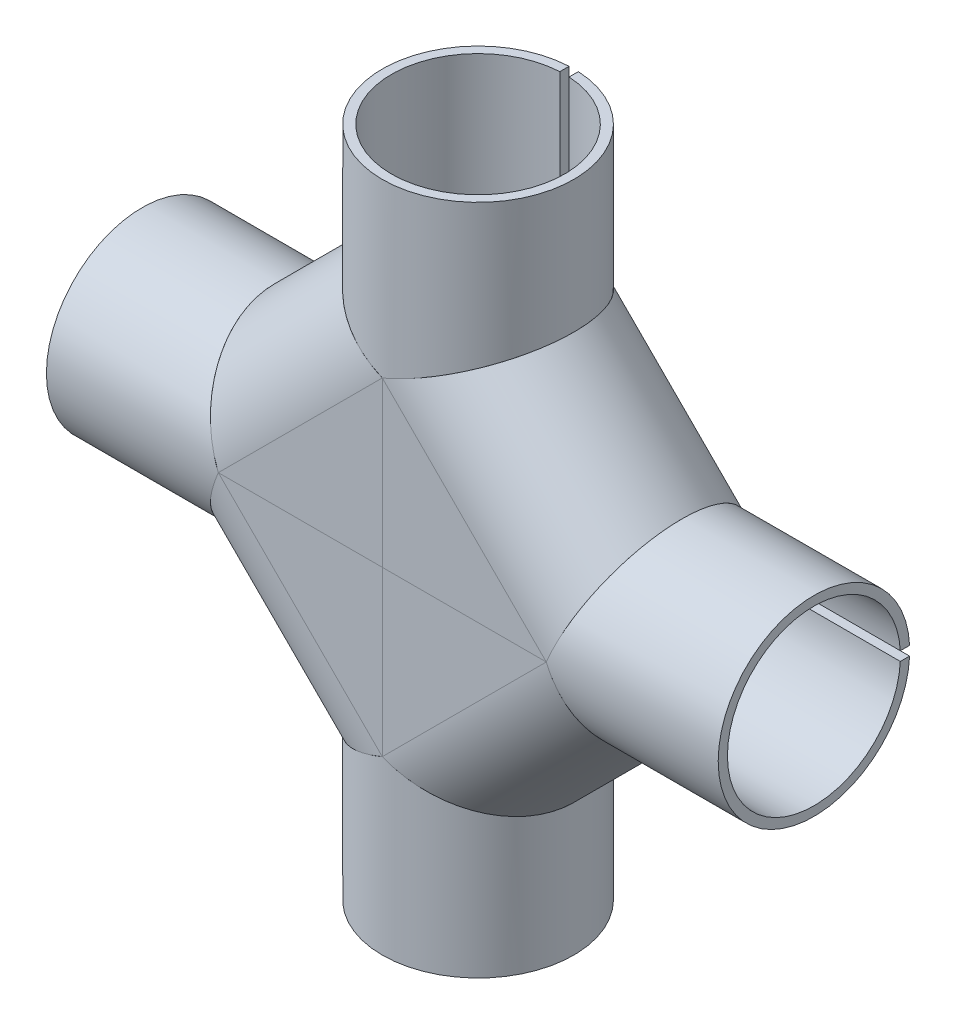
from build123d import *

# Parameters (mm, degrees)
SKETCH_2_R               = 10.351369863
SKETCH_2_R_2             = 9.351369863
EXTRUDE_1_DEPTH          = 36.311948
SKETCH_4_R               = 10.351369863
SKETCH_4_R_2             = 9.351369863
EXTRUDE_3_DEPTH          = 25.071572
CUT_EXTRUDE_2_DEPTH      = 46.311155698
CUT_EXTRUDE_2_DEPTH_BACK = 46.311155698
SKETCH_6_OUTSIDE_W       = 49.375
SKETCH_6_OUTSIDE_H       = 57.608
EXTRUDE_1_2_DEPTH        = 1
CUT_EXTRUDE_3_DEPTH      = 44.708245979
CUT_EXTRUDE_3_DEPTH_BACK = 44.708245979
SKETCH_7_OUTSIDE_W       = 44.941
SKETCH_7_OUTSIDE_H       = 48.886
SKETCH_1_W               = 1
SKETCH_1_H               = 36.31194825
CUT_EXTRUDE_1_DEPTH      = 44.708245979
PATTERN_CIRCULAR_1_COUNT = 4


with BuildPart() as part:
    # Sketch 2 → Extrude 1 (new body)
    with BuildSketch(Plane(origin=(0, 0, 0), x_dir=(1, 0, 0), z_dir=(0, 1, 0))):
        Circle(SKETCH_2_R)
        Circle(SKETCH_2_R_2, mode=Mode.SUBTRACT)
    extrude(amount=EXTRUDE_1_DEPTH)

    # Sketch 7 outside → Cut-Extrude 3 (cut, two sides: drawn at the far end of the back side and taken through both)
    with BuildSketch(Plane.XY.offset(-CUT_EXTRUDE_3_DEPTH_BACK)):
        with Locations((5.8325, 18.156)):
            Rectangle(SKETCH_7_OUTSIDE_W, SKETCH_7_OUTSIDE_H)
        Polygon((0, 17.728278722), (10.351369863, 22.015956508), (10.351369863, 36.31194825), (-10.351369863, 36.31194825), (-10.351369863, 22.015956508), align=None, mode=Mode.SUBTRACT)
    extrude(amount=CUT_EXTRUDE_3_DEPTH + CUT_EXTRUDE_3_DEPTH_BACK, mode=Mode.SUBTRACT)

    # Sketch 1 → Cut-Extrude 1 (cut, through all)
    with BuildSketch(Plane.XY):
        with Locations((0, 18.155974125)):
            Rectangle(SKETCH_1_W, SKETCH_1_H)
    extrude(amount=-CUT_EXTRUDE_1_DEPTH, mode=Mode.SUBTRACT)


with BuildPart() as body_2:
    # Sketch 4 → Extrude 3 (new body)
    with BuildSketch(Plane(origin=(0, 17.728278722, 0), x_dir=(0.7071067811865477, 0.7071067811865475, 0), z_dir=(0.7071067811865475, -0.7071067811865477, 0))):
        Circle(SKETCH_4_R)
        Circle(SKETCH_4_R_2, mode=Mode.SUBTRACT)
    extrude(amount=EXTRUDE_3_DEPTH)

    # Sketch 6 outside → Cut-Extrude 2 (cut, two sides: drawn at the far end of the back side and taken through both)
    with BuildSketch(Plane.XY.offset(-CUT_EXTRUDE_2_DEPTH_BACK)):
        with Locations((7.3485, 14.496)):
            Rectangle(SKETCH_6_OUTSIDE_W, SKETCH_6_OUTSIDE_H)
        Polygon((0, 17.728278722), (17.728278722, 0), (22.015956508, 10.351369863), (10.351369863, 22.015956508), align=None, mode=Mode.SUBTRACT)
    extrude(amount=CUT_EXTRUDE_2_DEPTH + CUT_EXTRUDE_2_DEPTH_BACK, mode=Mode.SUBTRACT)

    # Sketch 5 → Extrude 1 2 (add)
    with BuildSketch(Plane.XY.offset(10.351369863)):
        Polygon((0, 17.728278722), (0, 0), (17.728278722, 0), align=None)
    extrude_1_2 = extrude(amount=-EXTRUDE_1_2_DEPTH)

    # Mirror 1: Extrude 1 2 across plane
    add(extrude_1_2.mirror(Plane.XY))


with BuildPart() as pattern_circular_1_1:
    # Pattern Circular 1: pattern copy
    add(body_2.part.rotate(Axis((0, 0, 0), (0, 0, 1)), 1 * 360 / PATTERN_CIRCULAR_1_COUNT))


with BuildPart() as pattern_circular_1_2:
    # Pattern Circular 1: pattern copy
    add(body_2.part.rotate(Axis((0, 0, 0), (0, 0, 1)), 2 * 360 / PATTERN_CIRCULAR_1_COUNT))


with BuildPart() as pattern_circular_1_3:
    # Pattern Circular 1: pattern copy
    add(body_2.part.rotate(Axis((0, 0, 0), (0, 0, 1)), 3 * 360 / PATTERN_CIRCULAR_1_COUNT))


with BuildPart() as pattern_circular_1_4:
    # Pattern Circular 1: pattern copy
    add(part.part.rotate(Axis((0, 0, 0), (0, 0, 1)), 1 * 360 / PATTERN_CIRCULAR_1_COUNT))


with BuildPart() as pattern_circular_1_5:
    # Pattern Circular 1: pattern copy
    add(part.part.rotate(Axis((0, 0, 0), (0, 0, 1)), 2 * 360 / PATTERN_CIRCULAR_1_COUNT))


with BuildPart() as pattern_circular_1_6:
    # Pattern Circular 1: pattern copy
    add(part.part.rotate(Axis((0, 0, 0), (0, 0, 1)), 3 * 360 / PATTERN_CIRCULAR_1_COUNT))


solid = Compound([part.part, body_2.part, pattern_circular_1_1.part, pattern_circular_1_2.part, pattern_circular_1_3.part, pattern_circular_1_4.part, pattern_circular_1_5.part, pattern_circular_1_6.part])
